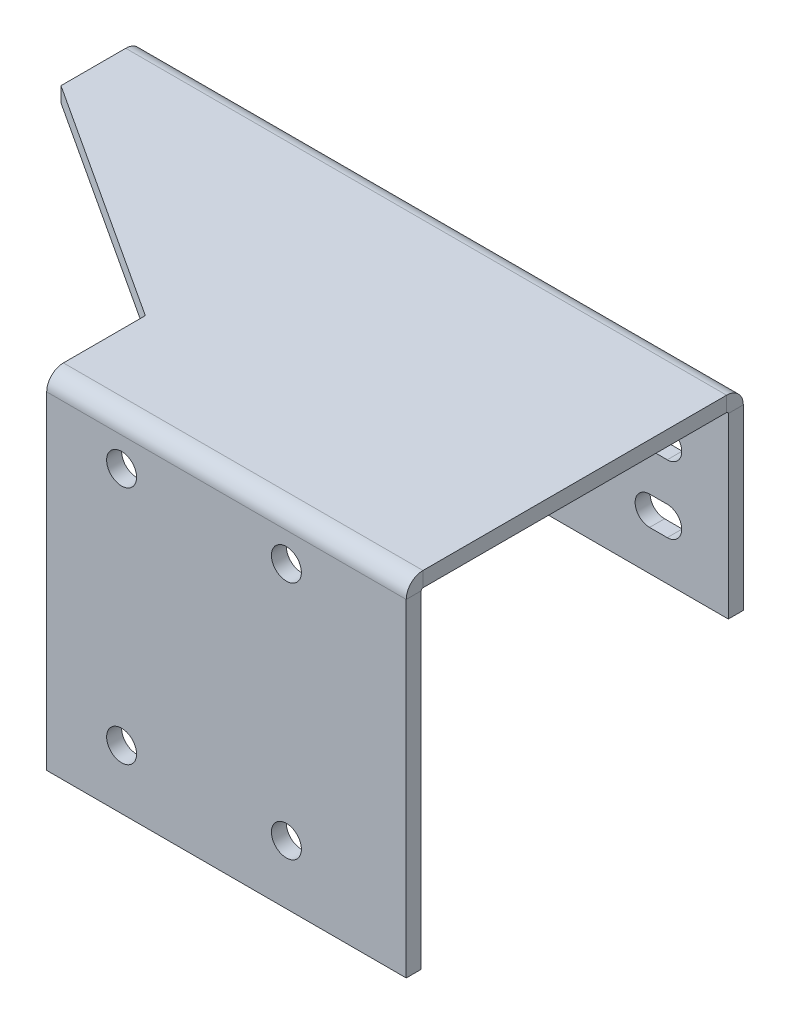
ISO-10303-21;
HEADER;
FILE_DESCRIPTION(('STEP AP214'),'2;1');
FILE_NAME('part.step','',(''),(''),'','','');
FILE_SCHEMA(('AUTOMOTIVE_DESIGN { 1 0 10303 214 1 1 1 1 }'));
ENDSEC;
DATA;
#1=APPLICATION_CONTEXT('core data for automotive mechanical design processes');
#2=APPLICATION_PROTOCOL_DEFINITION('international standard','automotive_design',2000,#1);
#3=PRODUCT_CONTEXT('',#1,'mechanical');
#4=PRODUCT('Part','Part','',(#3));
#5=PRODUCT_RELATED_PRODUCT_CATEGORY('part','',(#4));
#6=PRODUCT_DEFINITION_FORMATION('','',#4);
#7=PRODUCT_DEFINITION_CONTEXT('part definition',#1,'design');
#8=PRODUCT_DEFINITION('design','',#6,#7);
#9=PRODUCT_DEFINITION_SHAPE('','',#8);
#10=(LENGTH_UNIT() NAMED_UNIT(*) SI_UNIT(.MILLI.,.METRE.));
#11=(NAMED_UNIT(*) PLANE_ANGLE_UNIT() SI_UNIT($,.RADIAN.));
#12=(NAMED_UNIT(*) SI_UNIT($,.STERADIAN.) SOLID_ANGLE_UNIT());
#13=UNCERTAINTY_MEASURE_WITH_UNIT(LENGTH_MEASURE(1.E-05),#10,'distance_accuracy_value','');
#14=(GEOMETRIC_REPRESENTATION_CONTEXT(3) GLOBAL_UNCERTAINTY_ASSIGNED_CONTEXT((#13)) GLOBAL_UNIT_ASSIGNED_CONTEXT((#10,
#11,#12)) REPRESENTATION_CONTEXT('',''));
#15=CARTESIAN_POINT('',(0.,0.,0.));
#16=DIRECTION('',(0.,0.,1.));
#17=DIRECTION('',(1.,0.,0.));
#18=AXIS2_PLACEMENT_3D('',#15,#16,#17);
#19=CARTESIAN_POINT('',(0.,-6.35,0.));
#20=DIRECTION('',(0.,1.,0.));
#21=DIRECTION('',(0.,0.,1.));
#22=AXIS2_PLACEMENT_3D('',#19,#20,#21);
#23=PLANE('',#22);
#24=DIRECTION('',(-1.,0.,0.));
#25=VECTOR('',#24,1.);
#26=CARTESIAN_POINT('',(-25.0537000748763,-6.34999999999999,135.7884));
#27=LINE('',#26,#25);
#28=CARTESIAN_POINT('',(-25.0537000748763,-6.34999999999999,135.7884));
#29=VERTEX_POINT('',#28);
#30=CARTESIAN_POINT('',(127.346299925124,-6.34999999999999,135.7884));
#31=VERTEX_POINT('',#30);
#32=EDGE_CURVE('E443',#29,#31,#27,.F.);
#33=ORIENTED_EDGE('',*,*,#32,.F.);
#34=DIRECTION('',(0.,0.,1.));
#35=VECTOR('',#34,1.);
#36=CARTESIAN_POINT('',(-25.0537000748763,-6.35,101.071100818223));
#37=LINE('',#36,#35);
#38=CARTESIAN_POINT('',(-25.0537000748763,-6.35,101.071100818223));
#39=VERTEX_POINT('',#38);
#40=EDGE_CURVE('E514',#39,#29,#37,.T.);
#41=ORIENTED_EDGE('',*,*,#40,.F.);
#42=DIRECTION('',(0.838250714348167,0.,0.545285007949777));
#43=VECTOR('',#42,1.);
#44=CARTESIAN_POINT('',(-127.346299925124,-6.35,34.529408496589));
#45=LINE('',#44,#43);
#46=CARTESIAN_POINT('',(-127.346299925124,-6.35,34.529408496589));
#47=VERTEX_POINT('',#46);
#48=EDGE_CURVE('E510',#47,#39,#45,.T.);
#49=ORIENTED_EDGE('',*,*,#48,.F.);
#50=DIRECTION('',(0.,0.,1.));
#51=VECTOR('',#50,1.);
#52=CARTESIAN_POINT('',(-127.346299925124,-6.35,0.));
#53=LINE('',#52,#51);
#54=CARTESIAN_POINT('',(-127.346299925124,-6.35,7.08660000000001));
#55=VERTEX_POINT('',#54);
#56=EDGE_CURVE('E508',#55,#47,#53,.T.);
#57=ORIENTED_EDGE('',*,*,#56,.F.);
#58=DIRECTION('',(1.,0.,0.));
#59=VECTOR('',#58,1.);
#60=CARTESIAN_POINT('',(127.346299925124,-6.35,7.08660000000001));
#61=LINE('',#60,#59);
#62=CARTESIAN_POINT('',(127.346299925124,-6.35,7.08660000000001));
#63=VERTEX_POINT('',#62);
#64=EDGE_CURVE('E498',#63,#55,#61,.F.);
#65=ORIENTED_EDGE('',*,*,#64,.F.);
#66=DIRECTION('',(0.,0.,-1.));
#67=VECTOR('',#66,1.);
#68=CARTESIAN_POINT('',(127.346299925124,-6.35,142.875));
#69=LINE('',#68,#67);
#70=EDGE_CURVE('E517',#31,#63,#69,.T.);
#71=ORIENTED_EDGE('',*,*,#70,.F.);
#72=EDGE_LOOP('',(#33,#41,#49,#57,#65,#71));
#73=FACE_BOUND('',#72,.T.);
#74=ADVANCED_FACE('F77',(#73),#23,.F.);
#75=CARTESIAN_POINT('',(0.,0.,0.));
#76=DIRECTION('',(0.,1.,0.));
#77=DIRECTION('',(0.,0.,1.));
#78=AXIS2_PLACEMENT_3D('',#75,#76,#77);
#79=PLANE('',#78);
#80=DIRECTION('',(0.,0.,1.));
#81=VECTOR('',#80,1.);
#82=CARTESIAN_POINT('',(-25.0537000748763,0.,101.071100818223));
#83=LINE('',#82,#81);
#84=CARTESIAN_POINT('',(-25.0537000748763,0.,101.071100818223));
#85=VERTEX_POINT('',#84);
#86=CARTESIAN_POINT('',(-25.0537000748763,0.,135.7884));
#87=VERTEX_POINT('',#86);
#88=EDGE_CURVE('E523',#85,#87,#83,.T.);
#89=ORIENTED_EDGE('',*,*,#88,.T.);
#90=DIRECTION('',(-1.,0.,0.));
#91=VECTOR('',#90,1.);
#92=CARTESIAN_POINT('',(-25.0537000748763,0.,135.7884));
#93=LINE('',#92,#91);
#94=CARTESIAN_POINT('',(127.346299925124,0.,135.7884));
#95=VERTEX_POINT('',#94);
#96=EDGE_CURVE('E430',#87,#95,#93,.F.);
#97=ORIENTED_EDGE('',*,*,#96,.T.);
#98=DIRECTION('',(0.,0.,-1.));
#99=VECTOR('',#98,1.);
#100=CARTESIAN_POINT('',(127.346299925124,0.,142.875));
#101=LINE('',#100,#99);
#102=CARTESIAN_POINT('',(127.346299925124,0.,7.08660000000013));
#103=VERTEX_POINT('',#102);
#104=EDGE_CURVE('E511',#95,#103,#101,.T.);
#105=ORIENTED_EDGE('',*,*,#104,.T.);
#106=DIRECTION('',(1.,0.,0.));
#107=VECTOR('',#106,1.);
#108=CARTESIAN_POINT('',(127.346299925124,0.,7.08660000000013));
#109=LINE('',#108,#107);
#110=CARTESIAN_POINT('',(-127.346299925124,0.,7.08660000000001));
#111=VERTEX_POINT('',#110);
#112=EDGE_CURVE('E485',#103,#111,#109,.F.);
#113=ORIENTED_EDGE('',*,*,#112,.T.);
#114=DIRECTION('',(0.,0.,1.));
#115=VECTOR('',#114,1.);
#116=CARTESIAN_POINT('',(-127.346299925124,0.,0.));
#117=LINE('',#116,#115);
#118=CARTESIAN_POINT('',(-127.346299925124,0.,34.529408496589));
#119=VERTEX_POINT('',#118);
#120=EDGE_CURVE('E505',#111,#119,#117,.T.);
#121=ORIENTED_EDGE('',*,*,#120,.T.);
#122=DIRECTION('',(0.838250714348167,0.,0.545285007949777));
#123=VECTOR('',#122,1.);
#124=CARTESIAN_POINT('',(-127.346299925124,0.,34.529408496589));
#125=LINE('',#124,#123);
#126=EDGE_CURVE('E520',#119,#85,#125,.T.);
#127=ORIENTED_EDGE('',*,*,#126,.T.);
#128=EDGE_LOOP('',(#89,#97,#105,#113,#121,#127));
#129=FACE_BOUND('',#128,.T.);
#130=ADVANCED_FACE('F607',(#129),#79,.T.);
#131=CARTESIAN_POINT('',(-25.0537000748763,-6.35,101.071100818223));
#132=DIRECTION('',(-1.,0.,0.));
#133=DIRECTION('',(0.,0.,1.));
#134=AXIS2_PLACEMENT_3D('',#131,#132,#133);
#135=PLANE('',#134);
#136=ORIENTED_EDGE('',*,*,#40,.T.);
#137=DIRECTION('',(0.,1.,0.));
#138=VECTOR('',#137,1.);
#139=CARTESIAN_POINT('',(-25.0537000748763,-6.34999999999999,135.7884));
#140=LINE('',#139,#138);
#141=EDGE_CURVE('E437',#29,#87,#140,.T.);
#142=ORIENTED_EDGE('',*,*,#141,.T.);
#143=ORIENTED_EDGE('',*,*,#88,.F.);
#144=DIRECTION('',(0.,1.,0.));
#145=VECTOR('',#144,1.);
#146=CARTESIAN_POINT('',(-25.0537000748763,-6.35,101.071100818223));
#147=LINE('',#146,#145);
#148=EDGE_CURVE('E13',#39,#85,#147,.T.);
#149=ORIENTED_EDGE('',*,*,#148,.F.);
#150=EDGE_LOOP('',(#136,#142,#143,#149));
#151=FACE_BOUND('',#150,.T.);
#152=ADVANCED_FACE('F592',(#151),#135,.T.);
#153=CARTESIAN_POINT('',(127.346299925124,-6.35,142.875));
#154=DIRECTION('',(1.,0.,0.));
#155=DIRECTION('',(0.,0.,-1.));
#156=AXIS2_PLACEMENT_3D('',#153,#154,#155);
#157=PLANE('',#156);
#158=DIRECTION('',(0.,1.,0.));
#159=VECTOR('',#158,1.);
#160=CARTESIAN_POINT('',(127.346299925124,-6.34999999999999,135.7884));
#161=LINE('',#160,#159);
#162=EDGE_CURVE('E447',#31,#95,#161,.T.);
#163=ORIENTED_EDGE('',*,*,#162,.F.);
#164=ORIENTED_EDGE('',*,*,#70,.T.);
#165=DIRECTION('',(0.,1.,0.));
#166=VECTOR('',#165,1.);
#167=CARTESIAN_POINT('',(127.346299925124,-6.35,7.08660000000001));
#168=LINE('',#167,#166);
#169=EDGE_CURVE('E492',#63,#103,#168,.T.);
#170=ORIENTED_EDGE('',*,*,#169,.T.);
#171=ORIENTED_EDGE('',*,*,#104,.F.);
#172=EDGE_LOOP('',(#163,#164,#170,#171));
#173=FACE_BOUND('',#172,.T.);
#174=ADVANCED_FACE('F618',(#173),#157,.T.);
#175=CARTESIAN_POINT('',(-127.346299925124,-6.35,0.));
#176=DIRECTION('',(-1.,0.,0.));
#177=DIRECTION('',(0.,0.,1.));
#178=AXIS2_PLACEMENT_3D('',#175,#176,#177);
#179=PLANE('',#178);
#180=DIRECTION('',(0.,1.,0.));
#181=VECTOR('',#180,1.);
#182=CARTESIAN_POINT('',(-127.346299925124,-6.35,7.08660000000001));
#183=LINE('',#182,#181);
#184=EDGE_CURVE('E502',#55,#111,#183,.T.);
#185=ORIENTED_EDGE('',*,*,#184,.F.);
#186=ORIENTED_EDGE('',*,*,#56,.T.);
#187=DIRECTION('',(0.,1.,0.));
#188=VECTOR('',#187,1.);
#189=CARTESIAN_POINT('',(-127.346299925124,-6.35,34.529408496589));
#190=LINE('',#189,#188);
#191=EDGE_CURVE('E86',#47,#119,#190,.T.);
#192=ORIENTED_EDGE('',*,*,#191,.T.);
#193=ORIENTED_EDGE('',*,*,#120,.F.);
#194=EDGE_LOOP('',(#185,#186,#192,#193));
#195=FACE_BOUND('',#194,.T.);
#196=ADVANCED_FACE('F79',(#195),#179,.T.);
#197=CARTESIAN_POINT('',(-127.346299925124,-6.35,34.529408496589));
#198=DIRECTION('',(-0.545285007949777,0.,0.838250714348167));
#199=DIRECTION('',(0.838250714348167,0.,0.545285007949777));
#200=AXIS2_PLACEMENT_3D('',#197,#198,#199);
#201=PLANE('',#200);
#202=ORIENTED_EDGE('',*,*,#126,.F.);
#203=ORIENTED_EDGE('',*,*,#191,.F.);
#204=ORIENTED_EDGE('',*,*,#48,.T.);
#205=ORIENTED_EDGE('',*,*,#148,.T.);
#206=EDGE_LOOP('',(#202,#203,#204,#205));
#207=FACE_BOUND('',#206,.T.);
#208=ADVANCED_FACE('F596',(#207),#201,.T.);
#209=CARTESIAN_POINT('',(-127.346299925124,-7.08660000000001,7.0866));
#210=DIRECTION('',(-1.,0.,0.));
#211=DIRECTION('',(0.,0.,1.));
#212=AXIS2_PLACEMENT_3D('',#209,#210,#211);
#213=PLANE('',#212);
#214=DIRECTION('',(0.,0.,-1.));
#215=VECTOR('',#214,1.);
#216=CARTESIAN_POINT('',(-127.346299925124,-7.08659999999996,2.46800264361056E-13));
#217=LINE('',#216,#215);
#218=CARTESIAN_POINT('',(-127.346299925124,-7.08660000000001,6.34999999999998));
#219=VERTEX_POINT('',#218);
#220=CARTESIAN_POINT('',(-127.346299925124,-7.08659999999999,0.));
#221=VERTEX_POINT('',#220);
#222=EDGE_CURVE('E450',#219,#221,#217,.T.);
#223=ORIENTED_EDGE('',*,*,#222,.F.);
#224=CARTESIAN_POINT('',(-127.346299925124,-7.08660000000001,7.0866));
#225=DIRECTION('',(1.,0.,0.));
#226=DIRECTION('',(0.,0.,-1.));
#227=AXIS2_PLACEMENT_3D('',#224,#225,#226);
#228=CIRCLE('',#227,0.736600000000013);
#229=EDGE_CURVE('E495',#55,#219,#228,.F.);
#230=ORIENTED_EDGE('',*,*,#229,.F.);
#231=ORIENTED_EDGE('',*,*,#184,.T.);
#232=CARTESIAN_POINT('',(-127.346299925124,-7.08660000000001,7.0866));
#233=DIRECTION('',(1.,0.,0.));
#234=DIRECTION('',(0.,0.,-1.));
#235=AXIS2_PLACEMENT_3D('',#232,#233,#234);
#236=CIRCLE('',#235,7.08660000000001);
#237=EDGE_CURVE('E488',#111,#221,#236,.F.);
#238=ORIENTED_EDGE('',*,*,#237,.T.);
#239=EDGE_LOOP('',(#223,#230,#231,#238));
#240=FACE_BOUND('',#239,.T.);
#241=ADVANCED_FACE('F604',(#240),#213,.T.);
#242=CARTESIAN_POINT('',(127.346299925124,-7.08660000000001,7.0866));
#243=DIRECTION('',(-1.,0.,0.));
#244=DIRECTION('',(0.,0.,1.));
#245=AXIS2_PLACEMENT_3D('',#242,#243,#244);
#246=PLANE('',#245);
#247=CARTESIAN_POINT('',(127.346299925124,-7.08660000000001,7.0866));
#248=DIRECTION('',(1.,0.,0.));
#249=DIRECTION('',(0.,0.,-1.));
#250=AXIS2_PLACEMENT_3D('',#247,#248,#249);
#251=CIRCLE('',#250,0.736600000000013);
#252=CARTESIAN_POINT('',(127.346299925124,-7.08660000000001,6.34999999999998));
#253=VERTEX_POINT('',#252);
#254=EDGE_CURVE('E455',#253,#63,#251,.T.);
#255=ORIENTED_EDGE('',*,*,#254,.F.);
#256=DIRECTION('',(0.,0.,-1.));
#257=VECTOR('',#256,1.);
#258=CARTESIAN_POINT('',(127.346299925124,-7.08660000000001,6.35000000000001));
#259=LINE('',#258,#257);
#260=CARTESIAN_POINT('',(127.346299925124,-7.08659999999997,0.));
#261=VERTEX_POINT('',#260);
#262=EDGE_CURVE('E478',#253,#261,#259,.T.);
#263=ORIENTED_EDGE('',*,*,#262,.T.);
#264=CARTESIAN_POINT('',(127.346299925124,-7.08660000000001,7.0866));
#265=DIRECTION('',(1.,0.,0.));
#266=DIRECTION('',(0.,0.,-1.));
#267=AXIS2_PLACEMENT_3D('',#264,#265,#266);
#268=CIRCLE('',#267,7.08660000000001);
#269=EDGE_CURVE('E489',#261,#103,#268,.T.);
#270=ORIENTED_EDGE('',*,*,#269,.T.);
#271=ORIENTED_EDGE('',*,*,#169,.F.);
#272=EDGE_LOOP('',(#255,#263,#270,#271));
#273=FACE_BOUND('',#272,.T.);
#274=ADVANCED_FACE('F614',(#273),#246,.F.);
#275=CARTESIAN_POINT('',(127.346299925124,-7.08660000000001,7.0866));
#276=DIRECTION('',(1.,0.,0.));
#277=DIRECTION('',(0.,0.,-1.));
#278=AXIS2_PLACEMENT_3D('',#275,#276,#277);
#279=CYLINDRICAL_SURFACE('',#278,7.08660000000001);
#280=ORIENTED_EDGE('',*,*,#112,.F.);
#281=ORIENTED_EDGE('',*,*,#269,.F.);
#282=DIRECTION('',(1.,0.,0.));
#283=VECTOR('',#282,1.);
#284=CARTESIAN_POINT('',(0.,-7.08659999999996,0.));
#285=LINE('',#284,#283);
#286=EDGE_CURVE('E475',#221,#261,#285,.T.);
#287=ORIENTED_EDGE('',*,*,#286,.F.);
#288=ORIENTED_EDGE('',*,*,#237,.F.);
#289=EDGE_LOOP('',(#280,#281,#287,#288));
#290=FACE_BOUND('',#289,.T.);
#291=ADVANCED_FACE('F610',(#290),#279,.T.);
#292=CARTESIAN_POINT('',(127.346299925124,-7.08660000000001,7.0866));
#293=DIRECTION('',(1.,0.,0.));
#294=DIRECTION('',(0.,0.,-1.));
#295=AXIS2_PLACEMENT_3D('',#292,#293,#294);
#296=CYLINDRICAL_SURFACE('',#295,0.736600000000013);
#297=ORIENTED_EDGE('',*,*,#64,.T.);
#298=ORIENTED_EDGE('',*,*,#229,.T.);
#299=DIRECTION('',(-1.,0.,0.));
#300=VECTOR('',#299,1.);
#301=CARTESIAN_POINT('',(-127.346299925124,-7.0866,6.34999999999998));
#302=LINE('',#301,#300);
#303=EDGE_CURVE('E481',#219,#253,#302,.F.);
#304=ORIENTED_EDGE('',*,*,#303,.T.);
#305=ORIENTED_EDGE('',*,*,#254,.T.);
#306=EDGE_LOOP('',(#297,#298,#304,#305));
#307=FACE_BOUND('',#306,.T.);
#308=ADVANCED_FACE('F711',(#307),#296,.F.);
#309=CARTESIAN_POINT('',(127.346299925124,-6.34999999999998,0.));
#310=DIRECTION('',(1.,0.,0.));
#311=DIRECTION('',(0.,0.,-1.));
#312=AXIS2_PLACEMENT_3D('',#309,#310,#311);
#313=PLANE('',#312);
#314=DIRECTION('',(0.,1.,0.));
#315=VECTOR('',#314,1.);
#316=CARTESIAN_POINT('',(127.346299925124,-6.34999999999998,0.));
#317=LINE('',#316,#315);
#318=CARTESIAN_POINT('',(127.346299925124,-82.55,-2.51792591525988E-13));
#319=VERTEX_POINT('',#318);
#320=EDGE_CURVE('E459',#319,#261,#317,.T.);
#321=ORIENTED_EDGE('',*,*,#320,.T.);
#322=ORIENTED_EDGE('',*,*,#262,.F.);
#323=DIRECTION('',(0.,-1.,0.));
#324=VECTOR('',#323,1.);
#325=CARTESIAN_POINT('',(127.346299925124,0.,6.35000000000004));
#326=LINE('',#325,#324);
#327=CARTESIAN_POINT('',(127.346299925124,-82.55,6.34999999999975));
#328=VERTEX_POINT('',#327);
#329=EDGE_CURVE('E467',#328,#253,#326,.F.);
#330=ORIENTED_EDGE('',*,*,#329,.F.);
#331=DIRECTION('',(0.,0.,1.));
#332=VECTOR('',#331,1.);
#333=CARTESIAN_POINT('',(127.346299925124,-82.55,-2.52402265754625E-13));
#334=LINE('',#333,#332);
#335=EDGE_CURVE('E453',#319,#328,#334,.T.);
#336=ORIENTED_EDGE('',*,*,#335,.F.);
#337=EDGE_LOOP('',(#321,#322,#330,#336));
#338=FACE_BOUND('',#337,.T.);
#339=ADVANCED_FACE('F698',(#338),#313,.T.);
#340=CARTESIAN_POINT('',(-127.346299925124,-82.55,-2.80157841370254E-13));
#341=DIRECTION('',(-1.,0.,0.));
#342=DIRECTION('',(0.,0.,1.));
#343=AXIS2_PLACEMENT_3D('',#340,#341,#342);
#344=PLANE('',#343);
#345=DIRECTION('',(0.,1.,0.));
#346=VECTOR('',#345,1.);
#347=CARTESIAN_POINT('',(-127.346299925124,0.,6.35000000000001));
#348=LINE('',#347,#346);
#349=CARTESIAN_POINT('',(-127.346299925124,-82.55,6.34999999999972));
#350=VERTEX_POINT('',#349);
#351=EDGE_CURVE('E473',#219,#350,#348,.F.);
#352=ORIENTED_EDGE('',*,*,#351,.F.);
#353=ORIENTED_EDGE('',*,*,#222,.T.);
#354=DIRECTION('',(0.,-1.,0.));
#355=VECTOR('',#354,1.);
#356=CARTESIAN_POINT('',(-127.346299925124,-82.55,-2.79548167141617E-13));
#357=LINE('',#356,#355);
#358=CARTESIAN_POINT('',(-127.346299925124,-82.55,-2.79548167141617E-13));
#359=VERTEX_POINT('',#358);
#360=EDGE_CURVE('E465',#221,#359,#357,.T.);
#361=ORIENTED_EDGE('',*,*,#360,.T.);
#362=DIRECTION('',(0.,0.,1.));
#363=VECTOR('',#362,1.);
#364=CARTESIAN_POINT('',(-127.346299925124,-82.55,-2.80157841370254E-13));
#365=LINE('',#364,#363);
#366=EDGE_CURVE('E456',#359,#350,#365,.T.);
#367=ORIENTED_EDGE('',*,*,#366,.T.);
#368=EDGE_LOOP('',(#352,#353,#361,#367));
#369=FACE_BOUND('',#368,.T.);
#370=ADVANCED_FACE('F692',(#369),#344,.T.);
#371=CARTESIAN_POINT('',(0.,0.,0.));
#372=DIRECTION('',(0.,0.,-1.));
#373=DIRECTION('',(0.,1.,0.));
#374=AXIS2_PLACEMENT_3D('',#371,#372,#373);
#375=PLANE('',#374);
#376=CARTESIAN_POINT('',(-97.9338975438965,-30.8991,0.));
#377=DIRECTION('',(0.,0.,-1.));
#378=DIRECTION('',(0.,1.,0.));
#379=AXIS2_PLACEMENT_3D('',#376,#377,#378);
#380=CIRCLE('',#379,6.12584142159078);
#381=CARTESIAN_POINT('',(-97.9338975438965,-24.7732585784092,0.));
#382=VERTEX_POINT('',#381);
#383=CARTESIAN_POINT('',(-97.9338975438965,-37.0249414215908,-1.17744355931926E-13));
#384=VERTEX_POINT('',#383);
#385=EDGE_CURVE('E308',#382,#384,#380,.T.);
#386=ORIENTED_EDGE('',*,*,#385,.F.);
#387=DIRECTION('',(1.,0.,0.));
#388=VECTOR('',#387,1.);
#389=CARTESIAN_POINT('',(0.,-24.7732585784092,0.));
#390=LINE('',#389,#388);
#391=CARTESIAN_POINT('',(-105.421037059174,-24.7732585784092,0.));
#392=VERTEX_POINT('',#391);
#393=EDGE_CURVE('E301',#392,#382,#390,.T.);
#394=ORIENTED_EDGE('',*,*,#393,.F.);
#395=CARTESIAN_POINT('',(-105.421037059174,-30.8991,0.));
#396=DIRECTION('',(0.,0.,-1.));
#397=DIRECTION('',(0.,1.,0.));
#398=AXIS2_PLACEMENT_3D('',#395,#396,#397);
#399=CIRCLE('',#398,6.12584142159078);
#400=CARTESIAN_POINT('',(-105.421037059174,-37.0249414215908,0.));
#401=VERTEX_POINT('',#400);
#402=EDGE_CURVE('E281',#401,#392,#399,.T.);
#403=ORIENTED_EDGE('',*,*,#402,.F.);
#404=DIRECTION('',(-1.,0.,0.));
#405=VECTOR('',#404,1.);
#406=CARTESIAN_POINT('',(0.,-37.0249414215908,-1.06720486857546E-13));
#407=LINE('',#406,#405);
#408=EDGE_CURVE('E306',#384,#401,#407,.T.);
#409=ORIENTED_EDGE('',*,*,#408,.F.);
#410=EDGE_LOOP('',(#386,#394,#403,#409));
#411=FACE_BOUND('',#410,.T.);
#412=CARTESIAN_POINT('',(-105.421037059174,-59.4741,-1.96674274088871E-13));
#413=DIRECTION('',(0.,0.,-1.));
#414=DIRECTION('',(0.,1.,0.));
#415=AXIS2_PLACEMENT_3D('',#412,#413,#414);
#416=CIRCLE('',#415,6.12584142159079);
#417=CARTESIAN_POINT('',(-105.421037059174,-65.5999414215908,-2.17490955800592E-13));
#418=VERTEX_POINT('',#417);
#419=CARTESIAN_POINT('',(-105.421037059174,-53.3482585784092,-1.74773390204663E-13));
#420=VERTEX_POINT('',#419);
#421=EDGE_CURVE('E337',#418,#420,#416,.T.);
#422=ORIENTED_EDGE('',*,*,#421,.F.);
#423=DIRECTION('',(-1.,0.,0.));
#424=VECTOR('',#423,1.);
#425=CARTESIAN_POINT('',(0.,-65.5999414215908,-2.06489566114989E-13));
#426=LINE('',#425,#424);
#427=CARTESIAN_POINT('',(-97.9338975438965,-65.5999414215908,-2.17162085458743E-13));
#428=VERTEX_POINT('',#427);
#429=EDGE_CURVE('E324',#428,#418,#426,.T.);
#430=ORIENTED_EDGE('',*,*,#429,.F.);
#431=CARTESIAN_POINT('',(-97.9338975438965,-59.4741,-1.95806912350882E-13));
#432=DIRECTION('',(0.,0.,-1.));
#433=DIRECTION('',(0.,1.,0.));
#434=AXIS2_PLACEMENT_3D('',#431,#432,#433);
#435=CIRCLE('',#434,6.12584142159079);
#436=CARTESIAN_POINT('',(-97.9338975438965,-53.3482585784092,-1.74339709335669E-13));
#437=VERTEX_POINT('',#436);
#438=EDGE_CURVE('E332',#437,#428,#435,.T.);
#439=ORIENTED_EDGE('',*,*,#438,.F.);
#440=DIRECTION('',(1.,0.,0.));
#441=VECTOR('',#440,1.);
#442=CARTESIAN_POINT('',(0.,-53.3482585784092,-1.63713044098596E-13));
#443=LINE('',#442,#441);
#444=EDGE_CURVE('E335',#420,#437,#443,.T.);
#445=ORIENTED_EDGE('',*,*,#444,.F.);
#446=EDGE_LOOP('',(#422,#430,#439,#445));
#447=FACE_BOUND('',#446,.T.);
#448=CARTESIAN_POINT('',(101.456102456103,-59.4741,-1.74122868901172E-13));
#449=DIRECTION('',(0.,0.,-1.));
#450=DIRECTION('',(0.,1.,0.));
#451=AXIS2_PLACEMENT_3D('',#448,#449,#450);
#452=CIRCLE('',#451,6.12584142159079);
#453=CARTESIAN_POINT('',(101.456102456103,-53.3482585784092,-1.53089346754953E-13));
#454=VERTEX_POINT('',#453);
#455=CARTESIAN_POINT('',(101.456102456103,-65.5999414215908,-1.95806912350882E-13));
#456=VERTEX_POINT('',#455);
#457=EDGE_CURVE('E366',#454,#456,#452,.T.);
#458=ORIENTED_EDGE('',*,*,#457,.F.);
#459=DIRECTION('',(1.,0.,0.));
#460=VECTOR('',#459,1.);
#461=CARTESIAN_POINT('',(0.,-53.3482585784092,-1.63713044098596E-13));
#462=LINE('',#461,#460);
#463=CARTESIAN_POINT('',(93.9689629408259,-53.3482585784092,-1.53472610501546E-13));
#464=VERTEX_POINT('',#463);
#465=EDGE_CURVE('E353',#464,#454,#462,.T.);
#466=ORIENTED_EDGE('',*,*,#465,.F.);
#467=CARTESIAN_POINT('',(93.9689629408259,-59.4741,-1.74773390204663E-13));
#468=DIRECTION('',(0.,0.,-1.));
#469=DIRECTION('',(0.,1.,0.));
#470=AXIS2_PLACEMENT_3D('',#467,#468,#469);
#471=CIRCLE('',#470,6.12584142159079);
#472=CARTESIAN_POINT('',(93.9689629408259,-65.5999414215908,-1.5330618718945E-13));
#473=VERTEX_POINT('',#472);
#474=EDGE_CURVE('E361',#473,#464,#471,.T.);
#475=ORIENTED_EDGE('',*,*,#474,.F.);
#476=DIRECTION('',(-1.,0.,0.));
#477=VECTOR('',#476,1.);
#478=CARTESIAN_POINT('',(0.,-65.5999414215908,-2.06489566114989E-13));
#479=LINE('',#478,#477);
#480=EDGE_CURVE('E364',#456,#473,#479,.T.);
#481=ORIENTED_EDGE('',*,*,#480,.F.);
#482=EDGE_LOOP('',(#458,#466,#475,#481));
#483=FACE_BOUND('',#482,.T.);
#484=CARTESIAN_POINT('',(93.9689629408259,-30.8991,0.));
#485=DIRECTION('',(0.,0.,-1.));
#486=DIRECTION('',(0.,1.,0.));
#487=AXIS2_PLACEMENT_3D('',#484,#485,#486);
#488=CIRCLE('',#487,6.12584142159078);
#489=CARTESIAN_POINT('',(93.9689629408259,-37.0249414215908,0.));
#490=VERTEX_POINT('',#489);
#491=CARTESIAN_POINT('',(93.9689629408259,-24.7732585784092,0.));
#492=VERTEX_POINT('',#491);
#493=EDGE_CURVE('E395',#490,#492,#488,.T.);
#494=ORIENTED_EDGE('',*,*,#493,.F.);
#495=DIRECTION('',(-1.,0.,0.));
#496=VECTOR('',#495,1.);
#497=CARTESIAN_POINT('',(0.,-37.0249414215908,-1.06720486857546E-13));
#498=LINE('',#497,#496);
#499=CARTESIAN_POINT('',(101.456102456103,-37.0249414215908,0.));
#500=VERTEX_POINT('',#499);
#501=EDGE_CURVE('E382',#500,#490,#498,.T.);
#502=ORIENTED_EDGE('',*,*,#501,.F.);
#503=CARTESIAN_POINT('',(101.456102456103,-30.8991,0.));
#504=DIRECTION('',(0.,0.,-1.));
#505=DIRECTION('',(0.,1.,0.));
#506=AXIS2_PLACEMENT_3D('',#503,#504,#505);
#507=CIRCLE('',#506,6.12584142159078);
#508=CARTESIAN_POINT('',(101.456102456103,-24.7732585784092,0.));
#509=VERTEX_POINT('',#508);
#510=EDGE_CURVE('E390',#509,#500,#507,.T.);
#511=ORIENTED_EDGE('',*,*,#510,.F.);
#512=DIRECTION('',(1.,0.,0.));
#513=VECTOR('',#512,1.);
#514=CARTESIAN_POINT('',(0.,-24.7732585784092,0.));
#515=LINE('',#514,#513);
#516=EDGE_CURVE('E393',#492,#509,#515,.T.);
#517=ORIENTED_EDGE('',*,*,#516,.F.);
#518=EDGE_LOOP('',(#494,#502,#511,#517));
#519=FACE_BOUND('',#518,.T.);
#520=ORIENTED_EDGE('',*,*,#360,.F.);
#521=ORIENTED_EDGE('',*,*,#286,.T.);
#522=ORIENTED_EDGE('',*,*,#320,.F.);
#523=DIRECTION('',(1.,0.,0.));
#524=VECTOR('',#523,1.);
#525=CARTESIAN_POINT('',(127.346299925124,-82.55,-2.51792591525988E-13));
#526=LINE('',#525,#524);
#527=EDGE_CURVE('E462',#359,#319,#526,.T.);
#528=ORIENTED_EDGE('',*,*,#527,.F.);
#529=EDGE_LOOP('',(#520,#521,#522,#528));
#530=FACE_BOUND('',#529,.T.);
#531=ADVANCED_FACE('F697',(#411,#447,#483,#519,#530),#375,.T.);
#532=CARTESIAN_POINT('',(0.,0.,6.35000000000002));
#533=DIRECTION('',(0.,0.,-1.));
#534=DIRECTION('',(0.,1.,0.));
#535=AXIS2_PLACEMENT_3D('',#532,#533,#534);
#536=PLANE('',#535);
#537=DIRECTION('',(-1.,0.,0.));
#538=VECTOR('',#537,1.);
#539=CARTESIAN_POINT('',(-97.9338975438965,-24.7732585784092,6.35000000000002));
#540=LINE('',#539,#538);
#541=CARTESIAN_POINT('',(-97.9338975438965,-24.7732585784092,6.34999999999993));
#542=VERTEX_POINT('',#541);
#543=CARTESIAN_POINT('',(-105.421037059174,-24.7732585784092,6.35000000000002));
#544=VERTEX_POINT('',#543);
#545=EDGE_CURVE('E287',#542,#544,#540,.T.);
#546=ORIENTED_EDGE('',*,*,#545,.F.);
#547=CARTESIAN_POINT('',(-97.9338975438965,-30.8991,6.35000000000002));
#548=DIRECTION('',(0.,0.,1.));
#549=DIRECTION('',(1.,0.,0.));
#550=AXIS2_PLACEMENT_3D('',#547,#548,#549);
#551=CIRCLE('',#550,6.12584142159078);
#552=CARTESIAN_POINT('',(-97.9338975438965,-37.0249414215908,6.35000000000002));
#553=VERTEX_POINT('',#552);
#554=EDGE_CURVE('E102',#553,#542,#551,.T.);
#555=ORIENTED_EDGE('',*,*,#554,.F.);
#556=DIRECTION('',(1.,0.,0.));
#557=VECTOR('',#556,1.);
#558=CARTESIAN_POINT('',(-105.421037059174,-37.0249414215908,6.35000000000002));
#559=LINE('',#558,#557);
#560=CARTESIAN_POINT('',(-105.421037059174,-37.0249414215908,6.35000000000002));
#561=VERTEX_POINT('',#560);
#562=EDGE_CURVE('E294',#561,#553,#559,.T.);
#563=ORIENTED_EDGE('',*,*,#562,.F.);
#564=CARTESIAN_POINT('',(-105.421037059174,-30.8991,6.35000000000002));
#565=DIRECTION('',(0.,0.,1.));
#566=DIRECTION('',(1.,0.,0.));
#567=AXIS2_PLACEMENT_3D('',#564,#565,#566);
#568=CIRCLE('',#567,6.12584142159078);
#569=EDGE_CURVE('E278',#544,#561,#568,.T.);
#570=ORIENTED_EDGE('',*,*,#569,.F.);
#571=EDGE_LOOP('',(#546,#555,#563,#570));
#572=FACE_BOUND('',#571,.T.);
#573=DIRECTION('',(1.,0.,0.));
#574=VECTOR('',#573,1.);
#575=CARTESIAN_POINT('',(-105.421037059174,-65.5999414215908,6.35000000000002));
#576=LINE('',#575,#574);
#577=CARTESIAN_POINT('',(-105.421037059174,-65.5999414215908,6.34999999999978));
#578=VERTEX_POINT('',#577);
#579=CARTESIAN_POINT('',(-97.9338975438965,-65.5999414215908,6.35000000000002));
#580=VERTEX_POINT('',#579);
#581=EDGE_CURVE('E312',#578,#580,#576,.T.);
#582=ORIENTED_EDGE('',*,*,#581,.F.);
#583=CARTESIAN_POINT('',(-105.421037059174,-59.4741,6.35000000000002));
#584=DIRECTION('',(0.,0.,1.));
#585=DIRECTION('',(1.,0.,0.));
#586=AXIS2_PLACEMENT_3D('',#583,#584,#585);
#587=CIRCLE('',#586,6.12584142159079);
#588=CARTESIAN_POINT('',(-105.421037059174,-53.3482585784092,6.35000000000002));
#589=VERTEX_POINT('',#588);
#590=EDGE_CURVE('E310',#589,#578,#587,.T.);
#591=ORIENTED_EDGE('',*,*,#590,.F.);
#592=DIRECTION('',(-1.,0.,0.));
#593=VECTOR('',#592,1.);
#594=CARTESIAN_POINT('',(-105.421037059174,-53.3482585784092,6.35000000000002));
#595=LINE('',#594,#593);
#596=CARTESIAN_POINT('',(-97.9338975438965,-53.3482585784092,6.35000000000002));
#597=VERTEX_POINT('',#596);
#598=EDGE_CURVE('E318',#597,#589,#595,.T.);
#599=ORIENTED_EDGE('',*,*,#598,.F.);
#600=CARTESIAN_POINT('',(-97.9338975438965,-59.4741,6.35000000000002));
#601=DIRECTION('',(0.,0.,1.));
#602=DIRECTION('',(1.,0.,0.));
#603=AXIS2_PLACEMENT_3D('',#600,#601,#602);
#604=CIRCLE('',#603,6.12584142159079);
#605=EDGE_CURVE('E315',#580,#597,#604,.T.);
#606=ORIENTED_EDGE('',*,*,#605,.F.);
#607=EDGE_LOOP('',(#582,#591,#599,#606));
#608=FACE_BOUND('',#607,.T.);
#609=DIRECTION('',(-1.,0.,0.));
#610=VECTOR('',#609,1.);
#611=CARTESIAN_POINT('',(101.456102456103,-53.3482585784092,6.35000000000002));
#612=LINE('',#611,#610);
#613=CARTESIAN_POINT('',(101.456102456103,-53.3482585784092,6.34999999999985));
#614=VERTEX_POINT('',#613);
#615=CARTESIAN_POINT('',(93.9689629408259,-53.3482585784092,6.35000000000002));
#616=VERTEX_POINT('',#615);
#617=EDGE_CURVE('E341',#614,#616,#612,.T.);
#618=ORIENTED_EDGE('',*,*,#617,.F.);
#619=CARTESIAN_POINT('',(101.456102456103,-59.4741,6.35000000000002));
#620=DIRECTION('',(0.,0.,1.));
#621=DIRECTION('',(1.,0.,0.));
#622=AXIS2_PLACEMENT_3D('',#619,#620,#621);
#623=CIRCLE('',#622,6.12584142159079);
#624=CARTESIAN_POINT('',(101.456102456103,-65.5999414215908,6.35000000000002));
#625=VERTEX_POINT('',#624);
#626=EDGE_CURVE('E339',#625,#614,#623,.T.);
#627=ORIENTED_EDGE('',*,*,#626,.F.);
#628=DIRECTION('',(1.,0.,0.));
#629=VECTOR('',#628,1.);
#630=CARTESIAN_POINT('',(93.9689629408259,-65.5999414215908,6.35000000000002));
#631=LINE('',#630,#629);
#632=CARTESIAN_POINT('',(93.9689629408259,-65.5999414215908,6.35000000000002));
#633=VERTEX_POINT('',#632);
#634=EDGE_CURVE('E347',#633,#625,#631,.T.);
#635=ORIENTED_EDGE('',*,*,#634,.F.);
#636=CARTESIAN_POINT('',(93.9689629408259,-59.4741,6.35000000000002));
#637=DIRECTION('',(0.,0.,1.));
#638=DIRECTION('',(1.,0.,0.));
#639=AXIS2_PLACEMENT_3D('',#636,#637,#638);
#640=CIRCLE('',#639,6.12584142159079);
#641=EDGE_CURVE('E344',#616,#633,#640,.T.);
#642=ORIENTED_EDGE('',*,*,#641,.F.);
#643=EDGE_LOOP('',(#618,#627,#635,#642));
#644=FACE_BOUND('',#643,.T.);
#645=DIRECTION('',(1.,0.,0.));
#646=VECTOR('',#645,1.);
#647=CARTESIAN_POINT('',(93.9689629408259,-37.0249414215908,6.35000000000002));
#648=LINE('',#647,#646);
#649=CARTESIAN_POINT('',(93.9689629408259,-37.0249414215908,6.3499999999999));
#650=VERTEX_POINT('',#649);
#651=CARTESIAN_POINT('',(101.456102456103,-37.0249414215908,6.35000000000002));
#652=VERTEX_POINT('',#651);
#653=EDGE_CURVE('E370',#650,#652,#648,.T.);
#654=ORIENTED_EDGE('',*,*,#653,.F.);
#655=CARTESIAN_POINT('',(93.9689629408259,-30.8991,6.35000000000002));
#656=DIRECTION('',(0.,0.,1.));
#657=DIRECTION('',(1.,0.,0.));
#658=AXIS2_PLACEMENT_3D('',#655,#656,#657);
#659=CIRCLE('',#658,6.12584142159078);
#660=CARTESIAN_POINT('',(93.9689629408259,-24.7732585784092,6.35000000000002));
#661=VERTEX_POINT('',#660);
#662=EDGE_CURVE('E368',#661,#650,#659,.T.);
#663=ORIENTED_EDGE('',*,*,#662,.F.);
#664=DIRECTION('',(-1.,0.,0.));
#665=VECTOR('',#664,1.);
#666=CARTESIAN_POINT('',(101.456102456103,-24.7732585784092,6.35000000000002));
#667=LINE('',#666,#665);
#668=CARTESIAN_POINT('',(101.456102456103,-24.7732585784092,6.35000000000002));
#669=VERTEX_POINT('',#668);
#670=EDGE_CURVE('E376',#669,#661,#667,.T.);
#671=ORIENTED_EDGE('',*,*,#670,.F.);
#672=CARTESIAN_POINT('',(101.456102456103,-30.8991,6.35000000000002));
#673=DIRECTION('',(0.,0.,1.));
#674=DIRECTION('',(1.,0.,0.));
#675=AXIS2_PLACEMENT_3D('',#672,#673,#674);
#676=CIRCLE('',#675,6.12584142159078);
#677=EDGE_CURVE('E373',#652,#669,#676,.T.);
#678=ORIENTED_EDGE('',*,*,#677,.F.);
#679=EDGE_LOOP('',(#654,#663,#671,#678));
#680=FACE_BOUND('',#679,.T.);
#681=ORIENTED_EDGE('',*,*,#303,.F.);
#682=ORIENTED_EDGE('',*,*,#351,.T.);
#683=DIRECTION('',(-1.,0.,0.));
#684=VECTOR('',#683,1.);
#685=CARTESIAN_POINT('',(0.,-82.55,6.34999999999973));
#686=LINE('',#685,#684);
#687=EDGE_CURVE('E470',#350,#328,#686,.F.);
#688=ORIENTED_EDGE('',*,*,#687,.T.);
#689=ORIENTED_EDGE('',*,*,#329,.T.);
#690=EDGE_LOOP('',(#681,#682,#688,#689));
#691=FACE_BOUND('',#690,.T.);
#692=ADVANCED_FACE('F291',(#572,#608,#644,#680,#691),#536,.F.);
#693=CARTESIAN_POINT('',(127.346299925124,-82.55,-2.52402265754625E-13));
#694=DIRECTION('',(0.,-1.,0.));
#695=DIRECTION('',(0.,0.,-1.));
#696=AXIS2_PLACEMENT_3D('',#693,#694,#695);
#697=PLANE('',#696);
#698=ORIENTED_EDGE('',*,*,#687,.F.);
#699=ORIENTED_EDGE('',*,*,#366,.F.);
#700=ORIENTED_EDGE('',*,*,#527,.T.);
#701=ORIENTED_EDGE('',*,*,#335,.T.);
#702=EDGE_LOOP('',(#698,#699,#700,#701));
#703=FACE_BOUND('',#702,.T.);
#704=ADVANCED_FACE('F678',(#703),#697,.T.);
#705=CARTESIAN_POINT('',(127.346299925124,-7.0866,135.7884));
#706=DIRECTION('',(1.,0.,0.));
#707=DIRECTION('',(0.,0.,-1.));
#708=AXIS2_PLACEMENT_3D('',#705,#706,#707);
#709=PLANE('',#708);
#710=DIRECTION('',(0.,0.,1.));
#711=VECTOR('',#710,1.);
#712=CARTESIAN_POINT('',(127.346299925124,-7.0866,142.875000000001));
#713=LINE('',#712,#711);
#714=CARTESIAN_POINT('',(127.346299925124,-7.0866,136.525));
#715=VERTEX_POINT('',#714);
#716=CARTESIAN_POINT('',(127.346299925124,-7.08659999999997,142.875));
#717=VERTEX_POINT('',#716);
#718=EDGE_CURVE('E397',#715,#717,#713,.T.);
#719=ORIENTED_EDGE('',*,*,#718,.F.);
#720=CARTESIAN_POINT('',(127.346299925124,-7.0866,135.7884));
#721=DIRECTION('',(-1.,0.,0.));
#722=DIRECTION('',(0.,0.,1.));
#723=AXIS2_PLACEMENT_3D('',#720,#721,#722);
#724=CIRCLE('',#723,0.736600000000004);
#725=EDGE_CURVE('E440',#31,#715,#724,.F.);
#726=ORIENTED_EDGE('',*,*,#725,.F.);
#727=ORIENTED_EDGE('',*,*,#162,.T.);
#728=CARTESIAN_POINT('',(127.346299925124,-7.0866,135.7884));
#729=DIRECTION('',(-1.,0.,0.));
#730=DIRECTION('',(0.,0.,1.));
#731=AXIS2_PLACEMENT_3D('',#728,#729,#730);
#732=CIRCLE('',#731,7.0866);
#733=EDGE_CURVE('E433',#95,#717,#732,.F.);
#734=ORIENTED_EDGE('',*,*,#733,.T.);
#735=EDGE_LOOP('',(#719,#726,#727,#734));
#736=FACE_BOUND('',#735,.T.);
#737=ADVANCED_FACE('F620',(#736),#709,.T.);
#738=CARTESIAN_POINT('',(-25.0537000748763,-7.0866,135.7884));
#739=DIRECTION('',(1.,0.,0.));
#740=DIRECTION('',(0.,0.,-1.));
#741=AXIS2_PLACEMENT_3D('',#738,#739,#740);
#742=PLANE('',#741);
#743=CARTESIAN_POINT('',(-25.0537000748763,-7.0866,135.7884));
#744=DIRECTION('',(-1.,0.,0.));
#745=DIRECTION('',(0.,0.,1.));
#746=AXIS2_PLACEMENT_3D('',#743,#744,#745);
#747=CIRCLE('',#746,0.736600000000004);
#748=CARTESIAN_POINT('',(-25.0537000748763,-7.0866,136.525));
#749=VERTEX_POINT('',#748);
#750=EDGE_CURVE('E400',#749,#29,#747,.T.);
#751=ORIENTED_EDGE('',*,*,#750,.F.);
#752=DIRECTION('',(0.,0.,1.));
#753=VECTOR('',#752,1.);
#754=CARTESIAN_POINT('',(-25.0537000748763,-7.0866,136.525));
#755=LINE('',#754,#753);
#756=CARTESIAN_POINT('',(-25.0537000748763,-7.0866,142.875));
#757=VERTEX_POINT('',#756);
#758=EDGE_CURVE('E423',#749,#757,#755,.T.);
#759=ORIENTED_EDGE('',*,*,#758,.T.);
#760=CARTESIAN_POINT('',(-25.0537000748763,-7.0866,135.7884));
#761=DIRECTION('',(-1.,0.,0.));
#762=DIRECTION('',(0.,0.,1.));
#763=AXIS2_PLACEMENT_3D('',#760,#761,#762);
#764=CIRCLE('',#763,7.0866);
#765=EDGE_CURVE('E434',#757,#87,#764,.T.);
#766=ORIENTED_EDGE('',*,*,#765,.T.);
#767=ORIENTED_EDGE('',*,*,#141,.F.);
#768=EDGE_LOOP('',(#751,#759,#766,#767));
#769=FACE_BOUND('',#768,.T.);
#770=ADVANCED_FACE('F581',(#769),#742,.F.);
#771=CARTESIAN_POINT('',(-25.0537000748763,-7.0866,135.7884));
#772=DIRECTION('',(-1.,0.,0.));
#773=DIRECTION('',(0.,0.,1.));
#774=AXIS2_PLACEMENT_3D('',#771,#772,#773);
#775=CYLINDRICAL_SURFACE('',#774,7.0866);
#776=ORIENTED_EDGE('',*,*,#96,.F.);
#777=ORIENTED_EDGE('',*,*,#765,.F.);
#778=DIRECTION('',(-1.,0.,0.));
#779=VECTOR('',#778,1.);
#780=CARTESIAN_POINT('',(0.,-7.0866,142.875));
#781=LINE('',#780,#779);
#782=EDGE_CURVE('E420',#717,#757,#781,.T.);
#783=ORIENTED_EDGE('',*,*,#782,.F.);
#784=ORIENTED_EDGE('',*,*,#733,.F.);
#785=EDGE_LOOP('',(#776,#777,#783,#784));
#786=FACE_BOUND('',#785,.T.);
#787=ADVANCED_FACE('F622',(#786),#775,.T.);
#788=CARTESIAN_POINT('',(-25.0537000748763,-7.0866,135.7884));
#789=DIRECTION('',(-1.,0.,0.));
#790=DIRECTION('',(0.,0.,1.));
#791=AXIS2_PLACEMENT_3D('',#788,#789,#790);
#792=CYLINDRICAL_SURFACE('',#791,0.736600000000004);
#793=ORIENTED_EDGE('',*,*,#32,.T.);
#794=ORIENTED_EDGE('',*,*,#725,.T.);
#795=DIRECTION('',(1.,0.,0.));
#796=VECTOR('',#795,1.);
#797=CARTESIAN_POINT('',(127.346299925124,-7.0866,136.525));
#798=LINE('',#797,#796);
#799=EDGE_CURVE('E426',#715,#749,#798,.F.);
#800=ORIENTED_EDGE('',*,*,#799,.T.);
#801=ORIENTED_EDGE('',*,*,#750,.T.);
#802=EDGE_LOOP('',(#793,#794,#800,#801));
#803=FACE_BOUND('',#802,.T.);
#804=ADVANCED_FACE('F584',(#803),#792,.F.);
#805=CARTESIAN_POINT('',(-25.0537000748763,-6.34999999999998,142.875));
#806=DIRECTION('',(-1.,0.,0.));
#807=DIRECTION('',(0.,0.,1.));
#808=AXIS2_PLACEMENT_3D('',#805,#806,#807);
#809=PLANE('',#808);
#810=DIRECTION('',(0.,1.,0.));
#811=VECTOR('',#810,1.);
#812=CARTESIAN_POINT('',(-25.0537000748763,-6.34999999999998,142.875));
#813=LINE('',#812,#811);
#814=CARTESIAN_POINT('',(-25.0537000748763,-146.05,142.875000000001));
#815=VERTEX_POINT('',#814);
#816=EDGE_CURVE('E404',#815,#757,#813,.T.);
#817=ORIENTED_EDGE('',*,*,#816,.T.);
#818=ORIENTED_EDGE('',*,*,#758,.F.);
#819=DIRECTION('',(0.,-1.,0.));
#820=VECTOR('',#819,1.);
#821=CARTESIAN_POINT('',(-25.0537000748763,5.1095491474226E-13,136.525));
#822=LINE('',#821,#820);
#823=CARTESIAN_POINT('',(-25.0537000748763,-146.05,136.525000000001));
#824=VERTEX_POINT('',#823);
#825=EDGE_CURVE('E412',#824,#749,#822,.F.);
#826=ORIENTED_EDGE('',*,*,#825,.F.);
#827=DIRECTION('',(0.,0.,-1.));
#828=VECTOR('',#827,1.);
#829=CARTESIAN_POINT('',(-25.0537000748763,-146.05,142.875000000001));
#830=LINE('',#829,#828);
#831=EDGE_CURVE('E398',#815,#824,#830,.T.);
#832=ORIENTED_EDGE('',*,*,#831,.F.);
#833=EDGE_LOOP('',(#817,#818,#826,#832));
#834=FACE_BOUND('',#833,.T.);
#835=ADVANCED_FACE('F578',(#834),#809,.T.);
#836=CARTESIAN_POINT('',(127.346299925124,-146.05,142.875000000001));
#837=DIRECTION('',(1.,0.,0.));
#838=DIRECTION('',(0.,0.,-1.));
#839=AXIS2_PLACEMENT_3D('',#836,#837,#838);
#840=PLANE('',#839);
#841=DIRECTION('',(0.,1.,0.));
#842=VECTOR('',#841,1.);
#843=CARTESIAN_POINT('',(127.346299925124,5.1095491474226E-13,136.525));
#844=LINE('',#843,#842);
#845=CARTESIAN_POINT('',(127.346299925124,-146.05,136.525000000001));
#846=VERTEX_POINT('',#845);
#847=EDGE_CURVE('E418',#715,#846,#844,.F.);
#848=ORIENTED_EDGE('',*,*,#847,.F.);
#849=ORIENTED_EDGE('',*,*,#718,.T.);
#850=DIRECTION('',(0.,-1.,0.));
#851=VECTOR('',#850,1.);
#852=CARTESIAN_POINT('',(127.346299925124,-146.05,142.875000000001));
#853=LINE('',#852,#851);
#854=CARTESIAN_POINT('',(127.346299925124,-146.05,142.875000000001));
#855=VERTEX_POINT('',#854);
#856=EDGE_CURVE('E410',#717,#855,#853,.T.);
#857=ORIENTED_EDGE('',*,*,#856,.T.);
#858=DIRECTION('',(0.,0.,-1.));
#859=VECTOR('',#858,1.);
#860=CARTESIAN_POINT('',(127.346299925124,-146.05,142.875000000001));
#861=LINE('',#860,#859);
#862=EDGE_CURVE('E401',#855,#846,#861,.T.);
#863=ORIENTED_EDGE('',*,*,#862,.T.);
#864=EDGE_LOOP('',(#848,#849,#857,#863));
#865=FACE_BOUND('',#864,.T.);
#866=ADVANCED_FACE('F561',(#865),#840,.T.);
#867=CARTESIAN_POINT('',(0.,5.33125821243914E-13,142.875));
#868=DIRECTION('',(0.,0.,1.));
#869=DIRECTION('',(0.,-1.,0.));
#870=AXIS2_PLACEMENT_3D('',#867,#868,#869);
#871=PLANE('',#870);
#872=CARTESIAN_POINT('',(76.5462999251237,-121.0183,142.875));
#873=DIRECTION('',(0.,0.,1.));
#874=DIRECTION('',(1.,0.,0.));
#875=AXIS2_PLACEMENT_3D('',#872,#873,#874);
#876=CIRCLE('',#875,6.34999999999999);
#877=CARTESIAN_POINT('',(82.8962999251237,-121.0183,142.875));
#878=VERTEX_POINT('',#877);
#879=EDGE_CURVE('E548',#878,#878,#876,.T.);
#880=ORIENTED_EDGE('',*,*,#879,.F.);
#881=EDGE_LOOP('',(#880));
#882=FACE_BOUND('',#881,.T.);
#883=CARTESIAN_POINT('',(6.69629992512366,-121.0183,142.875));
#884=DIRECTION('',(0.,0.,1.));
#885=DIRECTION('',(1.,0.,0.));
#886=AXIS2_PLACEMENT_3D('',#883,#884,#885);
#887=CIRCLE('',#886,6.35000000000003);
#888=CARTESIAN_POINT('',(13.0462999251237,-121.0183,142.875));
#889=VERTEX_POINT('',#888);
#890=EDGE_CURVE('E538',#889,#889,#887,.T.);
#891=ORIENTED_EDGE('',*,*,#890,.F.);
#892=EDGE_LOOP('',(#891));
#893=FACE_BOUND('',#892,.T.);
#894=CARTESIAN_POINT('',(76.5462999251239,-19.4183,142.875));
#895=DIRECTION('',(0.,0.,1.));
#896=DIRECTION('',(1.,0.,0.));
#897=AXIS2_PLACEMENT_3D('',#894,#895,#896);
#898=CIRCLE('',#897,6.35000000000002);
#899=CARTESIAN_POINT('',(82.8962999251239,-19.4183,142.875));
#900=VERTEX_POINT('',#899);
#901=EDGE_CURVE('E535',#900,#900,#898,.T.);
#902=ORIENTED_EDGE('',*,*,#901,.F.);
#903=EDGE_LOOP('',(#902));
#904=FACE_BOUND('',#903,.T.);
#905=CARTESIAN_POINT('',(6.69629992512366,-19.4183,142.875));
#906=DIRECTION('',(0.,0.,1.));
#907=DIRECTION('',(1.,0.,0.));
#908=AXIS2_PLACEMENT_3D('',#905,#906,#907);
#909=CIRCLE('',#908,6.35000000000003);
#910=CARTESIAN_POINT('',(13.0462999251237,-19.4183,142.875));
#911=VERTEX_POINT('',#910);
#912=EDGE_CURVE('E532',#911,#911,#909,.T.);
#913=ORIENTED_EDGE('',*,*,#912,.F.);
#914=EDGE_LOOP('',(#913));
#915=FACE_BOUND('',#914,.T.);
#916=ORIENTED_EDGE('',*,*,#856,.F.);
#917=ORIENTED_EDGE('',*,*,#782,.T.);
#918=ORIENTED_EDGE('',*,*,#816,.F.);
#919=DIRECTION('',(-1.,0.,0.));
#920=VECTOR('',#919,1.);
#921=CARTESIAN_POINT('',(-25.0537000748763,-146.05,142.875000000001));
#922=LINE('',#921,#920);
#923=EDGE_CURVE('E407',#855,#815,#922,.T.);
#924=ORIENTED_EDGE('',*,*,#923,.F.);
#925=EDGE_LOOP('',(#916,#917,#918,#924));
#926=FACE_BOUND('',#925,.T.);
#927=ADVANCED_FACE('F557',(#882,#893,#904,#915,#926),#871,.T.);
#928=CARTESIAN_POINT('',(0.,5.1095491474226E-13,136.525));
#929=DIRECTION('',(0.,0.,1.));
#930=DIRECTION('',(0.,-1.,0.));
#931=AXIS2_PLACEMENT_3D('',#928,#929,#930);
#932=PLANE('',#931);
#933=CARTESIAN_POINT('',(76.5462999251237,-121.0183,136.525000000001));
#934=DIRECTION('',(0.,0.,1.));
#935=DIRECTION('',(0.,-1.,0.));
#936=AXIS2_PLACEMENT_3D('',#933,#934,#935);
#937=CIRCLE('',#936,6.34999999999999);
#938=CARTESIAN_POINT('',(76.5462999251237,-127.3683,136.525000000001));
#939=VERTEX_POINT('',#938);
#940=EDGE_CURVE('E81',#939,#939,#937,.T.);
#941=ORIENTED_EDGE('',*,*,#940,.T.);
#942=EDGE_LOOP('',(#941));
#943=FACE_BOUND('',#942,.T.);
#944=CARTESIAN_POINT('',(6.69629992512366,-121.0183,136.525000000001));
#945=DIRECTION('',(0.,0.,1.));
#946=DIRECTION('',(0.,-1.,0.));
#947=AXIS2_PLACEMENT_3D('',#944,#945,#946);
#948=CIRCLE('',#947,6.35000000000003);
#949=CARTESIAN_POINT('',(6.69629992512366,-127.3683,136.525000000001));
#950=VERTEX_POINT('',#949);
#951=EDGE_CURVE('E536',#950,#950,#948,.T.);
#952=ORIENTED_EDGE('',*,*,#951,.T.);
#953=EDGE_LOOP('',(#952));
#954=FACE_BOUND('',#953,.T.);
#955=CARTESIAN_POINT('',(76.5462999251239,-19.4183,136.525));
#956=DIRECTION('',(0.,0.,1.));
#957=DIRECTION('',(0.,-1.,0.));
#958=AXIS2_PLACEMENT_3D('',#955,#956,#957);
#959=CIRCLE('',#958,6.35000000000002);
#960=CARTESIAN_POINT('',(76.5462999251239,-25.7683000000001,136.525));
#961=VERTEX_POINT('',#960);
#962=EDGE_CURVE('E533',#961,#961,#959,.T.);
#963=ORIENTED_EDGE('',*,*,#962,.T.);
#964=EDGE_LOOP('',(#963));
#965=FACE_BOUND('',#964,.T.);
#966=CARTESIAN_POINT('',(6.69629992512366,-19.4183,136.525));
#967=DIRECTION('',(0.,0.,1.));
#968=DIRECTION('',(0.,-1.,0.));
#969=AXIS2_PLACEMENT_3D('',#966,#967,#968);
#970=CIRCLE('',#969,6.35000000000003);
#971=CARTESIAN_POINT('',(6.69629992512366,-25.7683000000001,136.525));
#972=VERTEX_POINT('',#971);
#973=EDGE_CURVE('E529',#972,#972,#970,.T.);
#974=ORIENTED_EDGE('',*,*,#973,.T.);
#975=EDGE_LOOP('',(#974));
#976=FACE_BOUND('',#975,.T.);
#977=ORIENTED_EDGE('',*,*,#799,.F.);
#978=ORIENTED_EDGE('',*,*,#847,.T.);
#979=DIRECTION('',(1.,0.,0.));
#980=VECTOR('',#979,1.);
#981=CARTESIAN_POINT('',(0.,-146.05,136.525000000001));
#982=LINE('',#981,#980);
#983=EDGE_CURVE('E415',#846,#824,#982,.F.);
#984=ORIENTED_EDGE('',*,*,#983,.T.);
#985=ORIENTED_EDGE('',*,*,#825,.T.);
#986=EDGE_LOOP('',(#977,#978,#984,#985));
#987=FACE_BOUND('',#986,.T.);
#988=ADVANCED_FACE('F560',(#943,#954,#965,#976,#987),#932,.F.);
#989=CARTESIAN_POINT('',(-25.0537000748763,-146.05,142.875000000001));
#990=DIRECTION('',(0.,-1.,0.));
#991=DIRECTION('',(0.,0.,-1.));
#992=AXIS2_PLACEMENT_3D('',#989,#990,#991);
#993=PLANE('',#992);
#994=ORIENTED_EDGE('',*,*,#983,.F.);
#995=ORIENTED_EDGE('',*,*,#862,.F.);
#996=ORIENTED_EDGE('',*,*,#923,.T.);
#997=ORIENTED_EDGE('',*,*,#831,.T.);
#998=EDGE_LOOP('',(#994,#995,#996,#997));
#999=FACE_BOUND('',#998,.T.);
#1000=ADVANCED_FACE('F572',(#999),#993,.T.);
#1001=CARTESIAN_POINT('',(93.9689629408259,-30.8991,-1.26999999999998));
#1002=DIRECTION('',(0.,0.,1.));
#1003=DIRECTION('',(1.,0.,0.));
#1004=AXIS2_PLACEMENT_3D('',#1001,#1002,#1003);
#1005=CYLINDRICAL_SURFACE('',#1004,6.12584142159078);
#1006=ORIENTED_EDGE('',*,*,#493,.T.);
#1007=DIRECTION('',(0.,0.,1.));
#1008=VECTOR('',#1007,1.);
#1009=CARTESIAN_POINT('',(93.9689629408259,-24.7732585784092,-1.26999999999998));
#1010=LINE('',#1009,#1008);
#1011=EDGE_CURVE('E380',#492,#661,#1010,.T.);
#1012=ORIENTED_EDGE('',*,*,#1011,.T.);
#1013=ORIENTED_EDGE('',*,*,#662,.T.);
#1014=DIRECTION('',(0.,0.,1.));
#1015=VECTOR('',#1014,1.);
#1016=CARTESIAN_POINT('',(93.9689629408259,-37.0249414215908,-1.26999999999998));
#1017=LINE('',#1016,#1015);
#1018=EDGE_CURVE('E379',#490,#650,#1017,.T.);
#1019=ORIENTED_EDGE('',*,*,#1018,.F.);
#1020=EDGE_LOOP('',(#1006,#1012,#1013,#1019));
#1021=FACE_BOUND('',#1020,.T.);
#1022=ADVANCED_FACE('F846',(#1021),#1005,.F.);
#1023=CARTESIAN_POINT('',(101.456102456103,-24.7732585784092,-1.26999999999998));
#1024=DIRECTION('',(0.,1.,0.));
#1025=DIRECTION('',(0.,0.,1.));
#1026=AXIS2_PLACEMENT_3D('',#1023,#1024,#1025);
#1027=PLANE('',#1026);
#1028=ORIENTED_EDGE('',*,*,#516,.T.);
#1029=DIRECTION('',(0.,0.,1.));
#1030=VECTOR('',#1029,1.);
#1031=CARTESIAN_POINT('',(101.456102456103,-24.7732585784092,-1.26999999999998));
#1032=LINE('',#1031,#1030);
#1033=EDGE_CURVE('E383',#509,#669,#1032,.T.);
#1034=ORIENTED_EDGE('',*,*,#1033,.T.);
#1035=ORIENTED_EDGE('',*,*,#670,.T.);
#1036=ORIENTED_EDGE('',*,*,#1011,.F.);
#1037=EDGE_LOOP('',(#1028,#1034,#1035,#1036));
#1038=FACE_BOUND('',#1037,.T.);
#1039=ADVANCED_FACE('F855',(#1038),#1027,.F.);
#1040=CARTESIAN_POINT('',(101.456102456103,-30.8991,-1.26999999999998));
#1041=DIRECTION('',(0.,0.,1.));
#1042=DIRECTION('',(1.,0.,0.));
#1043=AXIS2_PLACEMENT_3D('',#1040,#1041,#1042);
#1044=CYLINDRICAL_SURFACE('',#1043,6.12584142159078);
#1045=ORIENTED_EDGE('',*,*,#510,.T.);
#1046=DIRECTION('',(0.,0.,1.));
#1047=VECTOR('',#1046,1.);
#1048=CARTESIAN_POINT('',(101.456102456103,-37.0249414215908,-1.26999999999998));
#1049=LINE('',#1048,#1047);
#1050=EDGE_CURVE('E385',#500,#652,#1049,.T.);
#1051=ORIENTED_EDGE('',*,*,#1050,.T.);
#1052=ORIENTED_EDGE('',*,*,#677,.T.);
#1053=ORIENTED_EDGE('',*,*,#1033,.F.);
#1054=EDGE_LOOP('',(#1045,#1051,#1052,#1053));
#1055=FACE_BOUND('',#1054,.T.);
#1056=ADVANCED_FACE('F865',(#1055),#1044,.F.);
#1057=CARTESIAN_POINT('',(93.9689629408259,-37.0249414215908,-1.26999999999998));
#1058=DIRECTION('',(0.,-1.,0.));
#1059=DIRECTION('',(0.,0.,-1.));
#1060=AXIS2_PLACEMENT_3D('',#1057,#1058,#1059);
#1061=PLANE('',#1060);
#1062=ORIENTED_EDGE('',*,*,#501,.T.);
#1063=ORIENTED_EDGE('',*,*,#1018,.T.);
#1064=ORIENTED_EDGE('',*,*,#653,.T.);
#1065=ORIENTED_EDGE('',*,*,#1050,.F.);
#1066=EDGE_LOOP('',(#1062,#1063,#1064,#1065));
#1067=FACE_BOUND('',#1066,.T.);
#1068=ADVANCED_FACE('F875',(#1067),#1061,.F.);
#1069=CARTESIAN_POINT('',(101.456102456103,-59.4741,-1.26999999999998));
#1070=DIRECTION('',(0.,0.,1.));
#1071=DIRECTION('',(1.,0.,0.));
#1072=AXIS2_PLACEMENT_3D('',#1069,#1070,#1071);
#1073=CYLINDRICAL_SURFACE('',#1072,6.12584142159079);
#1074=ORIENTED_EDGE('',*,*,#457,.T.);
#1075=DIRECTION('',(0.,0.,1.));
#1076=VECTOR('',#1075,1.);
#1077=CARTESIAN_POINT('',(101.456102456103,-65.5999414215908,-1.26999999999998));
#1078=LINE('',#1077,#1076);
#1079=EDGE_CURVE('E351',#456,#625,#1078,.T.);
#1080=ORIENTED_EDGE('',*,*,#1079,.T.);
#1081=ORIENTED_EDGE('',*,*,#626,.T.);
#1082=DIRECTION('',(0.,0.,1.));
#1083=VECTOR('',#1082,1.);
#1084=CARTESIAN_POINT('',(101.456102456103,-53.3482585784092,-1.26999999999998));
#1085=LINE('',#1084,#1083);
#1086=EDGE_CURVE('E350',#454,#614,#1085,.T.);
#1087=ORIENTED_EDGE('',*,*,#1086,.F.);
#1088=EDGE_LOOP('',(#1074,#1080,#1081,#1087));
#1089=FACE_BOUND('',#1088,.T.);
#1090=ADVANCED_FACE('F885',(#1089),#1073,.F.);
#1091=CARTESIAN_POINT('',(93.9689629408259,-65.5999414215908,-1.26999999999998));
#1092=DIRECTION('',(0.,-1.,0.));
#1093=DIRECTION('',(0.,0.,-1.));
#1094=AXIS2_PLACEMENT_3D('',#1091,#1092,#1093);
#1095=PLANE('',#1094);
#1096=ORIENTED_EDGE('',*,*,#480,.T.);
#1097=DIRECTION('',(0.,0.,1.));
#1098=VECTOR('',#1097,1.);
#1099=CARTESIAN_POINT('',(93.9689629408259,-65.5999414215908,-1.26999999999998));
#1100=LINE('',#1099,#1098);
#1101=EDGE_CURVE('E354',#473,#633,#1100,.T.);
#1102=ORIENTED_EDGE('',*,*,#1101,.T.);
#1103=ORIENTED_EDGE('',*,*,#634,.T.);
#1104=ORIENTED_EDGE('',*,*,#1079,.F.);
#1105=EDGE_LOOP('',(#1096,#1102,#1103,#1104));
#1106=FACE_BOUND('',#1105,.T.);
#1107=ADVANCED_FACE('F895',(#1106),#1095,.F.);
#1108=CARTESIAN_POINT('',(93.9689629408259,-59.4741,-1.26999999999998));
#1109=DIRECTION('',(0.,0.,1.));
#1110=DIRECTION('',(1.,0.,0.));
#1111=AXIS2_PLACEMENT_3D('',#1108,#1109,#1110);
#1112=CYLINDRICAL_SURFACE('',#1111,6.12584142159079);
#1113=ORIENTED_EDGE('',*,*,#474,.T.);
#1114=DIRECTION('',(0.,0.,1.));
#1115=VECTOR('',#1114,1.);
#1116=CARTESIAN_POINT('',(93.9689629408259,-53.3482585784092,-1.26999999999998));
#1117=LINE('',#1116,#1115);
#1118=EDGE_CURVE('E356',#464,#616,#1117,.T.);
#1119=ORIENTED_EDGE('',*,*,#1118,.T.);
#1120=ORIENTED_EDGE('',*,*,#641,.T.);
#1121=ORIENTED_EDGE('',*,*,#1101,.F.);
#1122=EDGE_LOOP('',(#1113,#1119,#1120,#1121));
#1123=FACE_BOUND('',#1122,.T.);
#1124=ADVANCED_FACE('F905',(#1123),#1112,.F.);
#1125=CARTESIAN_POINT('',(101.456102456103,-53.3482585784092,-1.26999999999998));
#1126=DIRECTION('',(0.,1.,0.));
#1127=DIRECTION('',(0.,0.,1.));
#1128=AXIS2_PLACEMENT_3D('',#1125,#1126,#1127);
#1129=PLANE('',#1128);
#1130=ORIENTED_EDGE('',*,*,#465,.T.);
#1131=ORIENTED_EDGE('',*,*,#1086,.T.);
#1132=ORIENTED_EDGE('',*,*,#617,.T.);
#1133=ORIENTED_EDGE('',*,*,#1118,.F.);
#1134=EDGE_LOOP('',(#1130,#1131,#1132,#1133));
#1135=FACE_BOUND('',#1134,.T.);
#1136=ADVANCED_FACE('F915',(#1135),#1129,.F.);
#1137=CARTESIAN_POINT('',(-105.421037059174,-59.4741,-1.26999999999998));
#1138=DIRECTION('',(0.,0.,1.));
#1139=DIRECTION('',(1.,0.,0.));
#1140=AXIS2_PLACEMENT_3D('',#1137,#1138,#1139);
#1141=CYLINDRICAL_SURFACE('',#1140,6.12584142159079);
#1142=ORIENTED_EDGE('',*,*,#421,.T.);
#1143=DIRECTION('',(0.,0.,1.));
#1144=VECTOR('',#1143,1.);
#1145=CARTESIAN_POINT('',(-105.421037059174,-53.3482585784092,-1.26999999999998));
#1146=LINE('',#1145,#1144);
#1147=EDGE_CURVE('E322',#420,#589,#1146,.T.);
#1148=ORIENTED_EDGE('',*,*,#1147,.T.);
#1149=ORIENTED_EDGE('',*,*,#590,.T.);
#1150=DIRECTION('',(0.,0.,1.));
#1151=VECTOR('',#1150,1.);
#1152=CARTESIAN_POINT('',(-105.421037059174,-65.5999414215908,-1.26999999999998));
#1153=LINE('',#1152,#1151);
#1154=EDGE_CURVE('E321',#418,#578,#1153,.T.);
#1155=ORIENTED_EDGE('',*,*,#1154,.F.);
#1156=EDGE_LOOP('',(#1142,#1148,#1149,#1155));
#1157=FACE_BOUND('',#1156,.T.);
#1158=ADVANCED_FACE('F925',(#1157),#1141,.F.);
#1159=CARTESIAN_POINT('',(-105.421037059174,-53.3482585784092,-1.26999999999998));
#1160=DIRECTION('',(0.,1.,0.));
#1161=DIRECTION('',(0.,0.,1.));
#1162=AXIS2_PLACEMENT_3D('',#1159,#1160,#1161);
#1163=PLANE('',#1162);
#1164=ORIENTED_EDGE('',*,*,#444,.T.);
#1165=DIRECTION('',(0.,0.,1.));
#1166=VECTOR('',#1165,1.);
#1167=CARTESIAN_POINT('',(-97.9338975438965,-53.3482585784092,-1.26999999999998));
#1168=LINE('',#1167,#1166);
#1169=EDGE_CURVE('E325',#437,#597,#1168,.T.);
#1170=ORIENTED_EDGE('',*,*,#1169,.T.);
#1171=ORIENTED_EDGE('',*,*,#598,.T.);
#1172=ORIENTED_EDGE('',*,*,#1147,.F.);
#1173=EDGE_LOOP('',(#1164,#1170,#1171,#1172));
#1174=FACE_BOUND('',#1173,.T.);
#1175=ADVANCED_FACE('F935',(#1174),#1163,.F.);
#1176=CARTESIAN_POINT('',(-97.9338975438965,-59.4741,-1.26999999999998));
#1177=DIRECTION('',(0.,0.,1.));
#1178=DIRECTION('',(1.,0.,0.));
#1179=AXIS2_PLACEMENT_3D('',#1176,#1177,#1178);
#1180=CYLINDRICAL_SURFACE('',#1179,6.12584142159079);
#1181=ORIENTED_EDGE('',*,*,#438,.T.);
#1182=DIRECTION('',(0.,0.,1.));
#1183=VECTOR('',#1182,1.);
#1184=CARTESIAN_POINT('',(-97.9338975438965,-65.5999414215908,-1.26999999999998));
#1185=LINE('',#1184,#1183);
#1186=EDGE_CURVE('E327',#428,#580,#1185,.T.);
#1187=ORIENTED_EDGE('',*,*,#1186,.T.);
#1188=ORIENTED_EDGE('',*,*,#605,.T.);
#1189=ORIENTED_EDGE('',*,*,#1169,.F.);
#1190=EDGE_LOOP('',(#1181,#1187,#1188,#1189));
#1191=FACE_BOUND('',#1190,.T.);
#1192=ADVANCED_FACE('F945',(#1191),#1180,.F.);
#1193=CARTESIAN_POINT('',(-105.421037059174,-65.5999414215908,-1.26999999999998));
#1194=DIRECTION('',(0.,-1.,0.));
#1195=DIRECTION('',(0.,0.,-1.));
#1196=AXIS2_PLACEMENT_3D('',#1193,#1194,#1195);
#1197=PLANE('',#1196);
#1198=ORIENTED_EDGE('',*,*,#429,.T.);
#1199=ORIENTED_EDGE('',*,*,#1154,.T.);
#1200=ORIENTED_EDGE('',*,*,#581,.T.);
#1201=ORIENTED_EDGE('',*,*,#1186,.F.);
#1202=EDGE_LOOP('',(#1198,#1199,#1200,#1201));
#1203=FACE_BOUND('',#1202,.T.);
#1204=ADVANCED_FACE('F955',(#1203),#1197,.F.);
#1205=CARTESIAN_POINT('',(-97.9338975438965,-30.8991,-1.26999999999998));
#1206=DIRECTION('',(0.,0.,1.));
#1207=DIRECTION('',(1.,0.,0.));
#1208=AXIS2_PLACEMENT_3D('',#1205,#1206,#1207);
#1209=CYLINDRICAL_SURFACE('',#1208,6.12584142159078);
#1210=ORIENTED_EDGE('',*,*,#385,.T.);
#1211=DIRECTION('',(0.,0.,1.));
#1212=VECTOR('',#1211,1.);
#1213=CARTESIAN_POINT('',(-97.9338975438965,-37.0249414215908,-1.26999999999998));
#1214=LINE('',#1213,#1212);
#1215=EDGE_CURVE('E299',#384,#553,#1214,.T.);
#1216=ORIENTED_EDGE('',*,*,#1215,.T.);
#1217=ORIENTED_EDGE('',*,*,#554,.T.);
#1218=DIRECTION('',(0.,0.,1.));
#1219=VECTOR('',#1218,1.);
#1220=CARTESIAN_POINT('',(-97.9338975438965,-24.7732585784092,-1.26999999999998));
#1221=LINE('',#1220,#1219);
#1222=EDGE_CURVE('E284',#382,#542,#1221,.T.);
#1223=ORIENTED_EDGE('',*,*,#1222,.F.);
#1224=EDGE_LOOP('',(#1210,#1216,#1217,#1223));
#1225=FACE_BOUND('',#1224,.T.);
#1226=ADVANCED_FACE('F965',(#1225),#1209,.F.);
#1227=CARTESIAN_POINT('',(-105.421037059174,-37.0249414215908,-1.26999999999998));
#1228=DIRECTION('',(0.,-1.,0.));
#1229=DIRECTION('',(0.,0.,-1.));
#1230=AXIS2_PLACEMENT_3D('',#1227,#1228,#1229);
#1231=PLANE('',#1230);
#1232=ORIENTED_EDGE('',*,*,#408,.T.);
#1233=DIRECTION('',(0.,0.,1.));
#1234=VECTOR('',#1233,1.);
#1235=CARTESIAN_POINT('',(-105.421037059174,-37.0249414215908,-1.26999999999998));
#1236=LINE('',#1235,#1234);
#1237=EDGE_CURVE('E283',#401,#561,#1236,.T.);
#1238=ORIENTED_EDGE('',*,*,#1237,.T.);
#1239=ORIENTED_EDGE('',*,*,#562,.T.);
#1240=ORIENTED_EDGE('',*,*,#1215,.F.);
#1241=EDGE_LOOP('',(#1232,#1238,#1239,#1240));
#1242=FACE_BOUND('',#1241,.T.);
#1243=ADVANCED_FACE('F975',(#1242),#1231,.F.);
#1244=CARTESIAN_POINT('',(-105.421037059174,-30.8991,-1.26999999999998));
#1245=DIRECTION('',(0.,0.,1.));
#1246=DIRECTION('',(1.,0.,0.));
#1247=AXIS2_PLACEMENT_3D('',#1244,#1245,#1246);
#1248=CYLINDRICAL_SURFACE('',#1247,6.12584142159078);
#1249=ORIENTED_EDGE('',*,*,#402,.T.);
#1250=DIRECTION('',(0.,0.,1.));
#1251=VECTOR('',#1250,1.);
#1252=CARTESIAN_POINT('',(-105.421037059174,-24.7732585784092,-1.26999999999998));
#1253=LINE('',#1252,#1251);
#1254=EDGE_CURVE('E94',#392,#544,#1253,.T.);
#1255=ORIENTED_EDGE('',*,*,#1254,.T.);
#1256=ORIENTED_EDGE('',*,*,#569,.T.);
#1257=ORIENTED_EDGE('',*,*,#1237,.F.);
#1258=EDGE_LOOP('',(#1249,#1255,#1256,#1257));
#1259=FACE_BOUND('',#1258,.T.);
#1260=ADVANCED_FACE('F275',(#1259),#1248,.F.);
#1261=CARTESIAN_POINT('',(-97.9338975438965,-24.7732585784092,-1.26999999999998));
#1262=DIRECTION('',(0.,1.,0.));
#1263=DIRECTION('',(0.,0.,1.));
#1264=AXIS2_PLACEMENT_3D('',#1261,#1262,#1263);
#1265=PLANE('',#1264);
#1266=ORIENTED_EDGE('',*,*,#393,.T.);
#1267=ORIENTED_EDGE('',*,*,#1222,.T.);
#1268=ORIENTED_EDGE('',*,*,#545,.T.);
#1269=ORIENTED_EDGE('',*,*,#1254,.F.);
#1270=EDGE_LOOP('',(#1266,#1267,#1268,#1269));
#1271=FACE_BOUND('',#1270,.T.);
#1272=ADVANCED_FACE('F288',(#1271),#1265,.F.);
#1273=CARTESIAN_POINT('',(6.69629992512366,-19.4183,135.255));
#1274=DIRECTION('',(0.,0.,1.));
#1275=DIRECTION('',(1.,0.,0.));
#1276=AXIS2_PLACEMENT_3D('',#1273,#1274,#1275);
#1277=CYLINDRICAL_SURFACE('',#1276,6.35000000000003);
#1278=ORIENTED_EDGE('',*,*,#912,.T.);
#1279=EDGE_LOOP('',(#1278));
#1280=FACE_BOUND('',#1279,.T.);
#1281=ORIENTED_EDGE('',*,*,#973,.F.);
#1282=EDGE_LOOP('',(#1281));
#1283=FACE_BOUND('',#1282,.T.);
#1284=ADVANCED_FACE('F554',(#1280,#1283),#1277,.F.);
#1285=CARTESIAN_POINT('',(76.5462999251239,-19.4183,135.255));
#1286=DIRECTION('',(0.,0.,1.));
#1287=DIRECTION('',(1.,0.,0.));
#1288=AXIS2_PLACEMENT_3D('',#1285,#1286,#1287);
#1289=CYLINDRICAL_SURFACE('',#1288,6.35000000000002);
#1290=ORIENTED_EDGE('',*,*,#901,.T.);
#1291=EDGE_LOOP('',(#1290));
#1292=FACE_BOUND('',#1291,.T.);
#1293=ORIENTED_EDGE('',*,*,#962,.F.);
#1294=EDGE_LOOP('',(#1293));
#1295=FACE_BOUND('',#1294,.T.);
#1296=ADVANCED_FACE('F1009',(#1292,#1295),#1289,.F.);
#1297=CARTESIAN_POINT('',(6.69629992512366,-121.0183,135.255));
#1298=DIRECTION('',(0.,0.,1.));
#1299=DIRECTION('',(1.,0.,0.));
#1300=AXIS2_PLACEMENT_3D('',#1297,#1298,#1299);
#1301=CYLINDRICAL_SURFACE('',#1300,6.35000000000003);
#1302=ORIENTED_EDGE('',*,*,#890,.T.);
#1303=EDGE_LOOP('',(#1302));
#1304=FACE_BOUND('',#1303,.T.);
#1305=ORIENTED_EDGE('',*,*,#951,.F.);
#1306=EDGE_LOOP('',(#1305));
#1307=FACE_BOUND('',#1306,.T.);
#1308=ADVANCED_FACE('F1018',(#1304,#1307),#1301,.F.);
#1309=CARTESIAN_POINT('',(76.5462999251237,-121.0183,135.255));
#1310=DIRECTION('',(0.,0.,1.));
#1311=DIRECTION('',(1.,0.,0.));
#1312=AXIS2_PLACEMENT_3D('',#1309,#1310,#1311);
#1313=CYLINDRICAL_SURFACE('',#1312,6.34999999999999);
#1314=ORIENTED_EDGE('',*,*,#879,.T.);
#1315=EDGE_LOOP('',(#1314));
#1316=FACE_BOUND('',#1315,.T.);
#1317=ORIENTED_EDGE('',*,*,#940,.F.);
#1318=EDGE_LOOP('',(#1317));
#1319=FACE_BOUND('',#1318,.T.);
#1320=ADVANCED_FACE('F1028',(#1316,#1319),#1313,.F.);
#1321=CLOSED_SHELL('',(#74,#130,#152,#174,#196,#208,#241,#274,#291,#308,#339,#370,#531,#692,
#704,#737,#770,#787,#804,#835,#866,#927,#988,#1000,#1022,#1039,#1056,#1068,#1090,#1107,#1124,
#1136,#1158,#1175,#1192,#1204,#1226,#1243,#1260,#1272,#1284,#1296,#1308,#1320));
#1322=MANIFOLD_SOLID_BREP('B2',#1321);
#1323=ADVANCED_BREP_SHAPE_REPRESENTATION('',(#18,#1322),#14);
#1324=SHAPE_DEFINITION_REPRESENTATION(#9,#1323);
ENDSEC;
END-ISO-10303-21;
